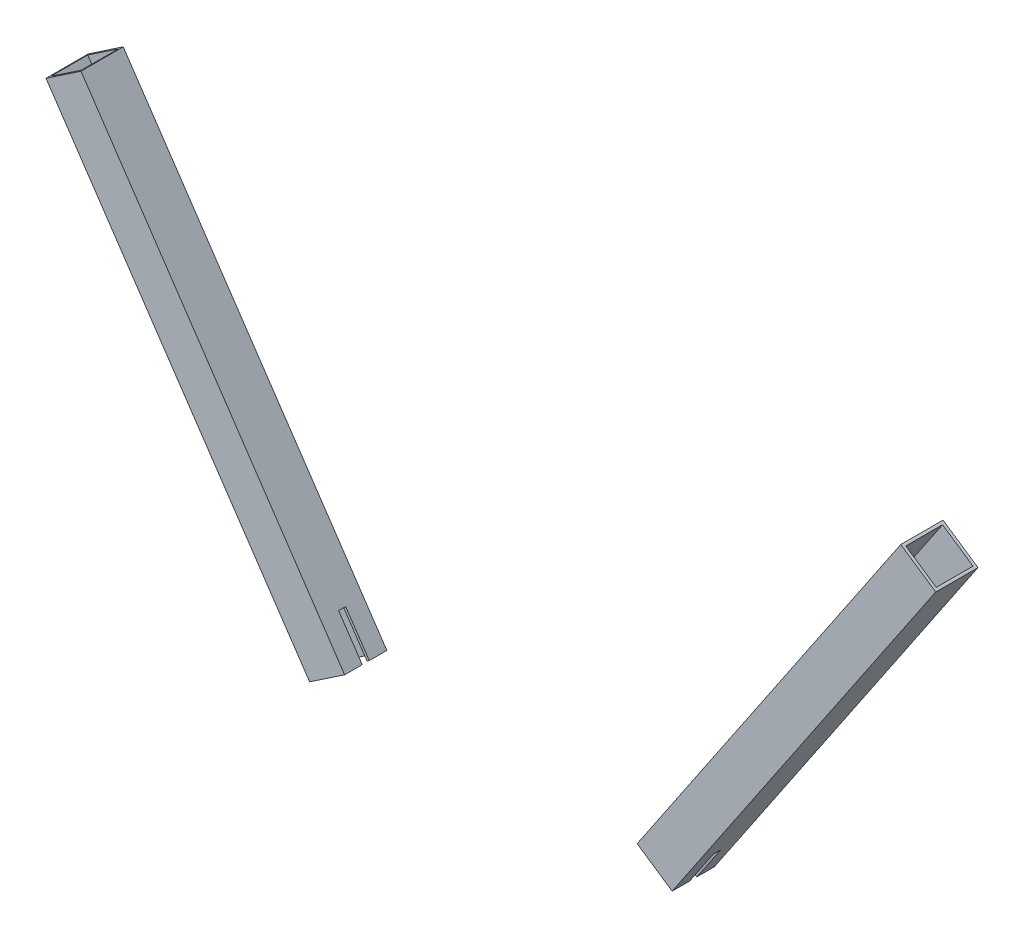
ISO-10303-21;
HEADER;
FILE_DESCRIPTION(('STEP AP214'),'2;1');
FILE_NAME('part.step','',(''),(''),'','','');
FILE_SCHEMA(('AUTOMOTIVE_DESIGN { 1 0 10303 214 1 1 1 1 }'));
ENDSEC;
DATA;
#1=APPLICATION_CONTEXT('core data for automotive mechanical design processes');
#2=APPLICATION_PROTOCOL_DEFINITION('international standard','automotive_design',2000,#1);
#3=PRODUCT_CONTEXT('',#1,'mechanical');
#4=PRODUCT('Part','Part','',(#3));
#5=PRODUCT_RELATED_PRODUCT_CATEGORY('part','',(#4));
#6=PRODUCT_DEFINITION_FORMATION('','',#4);
#7=PRODUCT_DEFINITION_CONTEXT('part definition',#1,'design');
#8=PRODUCT_DEFINITION('design','',#6,#7);
#9=PRODUCT_DEFINITION_SHAPE('','',#8);
#10=(LENGTH_UNIT() NAMED_UNIT(*) SI_UNIT(.MILLI.,.METRE.));
#11=(NAMED_UNIT(*) PLANE_ANGLE_UNIT() SI_UNIT($,.RADIAN.));
#12=(NAMED_UNIT(*) SI_UNIT($,.STERADIAN.) SOLID_ANGLE_UNIT());
#13=UNCERTAINTY_MEASURE_WITH_UNIT(LENGTH_MEASURE(1.E-05),#10,'distance_accuracy_value','');
#14=(GEOMETRIC_REPRESENTATION_CONTEXT(3) GLOBAL_UNCERTAINTY_ASSIGNED_CONTEXT((#13)) GLOBAL_UNIT_ASSIGNED_CONTEXT((#10,
#11,#12)) REPRESENTATION_CONTEXT('',''));
#15=CARTESIAN_POINT('',(0.,0.,0.));
#16=DIRECTION('',(0.,0.,1.));
#17=DIRECTION('',(1.,0.,0.));
#18=AXIS2_PLACEMENT_3D('',#15,#16,#17);
#19=CARTESIAN_POINT('',(-73.99949599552,101.56548835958,-1.5875));
#20=DIRECTION('',(0.559119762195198,-0.829086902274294,0.));
#21=DIRECTION('',(0.,0.,-1.));
#22=AXIS2_PLACEMENT_3D('',#19,#20,#21);
#23=PLANE('',#22);
#24=DIRECTION('',(-0.829086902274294,-0.559119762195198,0.));
#25=VECTOR('',#24,1.);
#26=CARTESIAN_POINT('',(-73.99949599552,101.56548835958,-1.5875));
#27=LINE('',#26,#25);
#28=CARTESIAN_POINT('',(-91.41512964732,89.820730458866,-1.5875));
#29=VERTEX_POINT('',#28);
#30=CARTESIAN_POINT('',(-92.42595239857,89.139051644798,-1.5875));
#31=VERTEX_POINT('',#30);
#32=EDGE_CURVE('P0_E307',#29,#31,#27,.T.);
#33=ORIENTED_EDGE('',*,*,#32,.F.);
#34=DIRECTION('',(0.,0.,1.));
#35=VECTOR('',#34,1.);
#36=CARTESIAN_POINT('',(-91.41512964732,89.820730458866,-4.94665));
#37=LINE('',#36,#35);
#38=CARTESIAN_POINT('',(-91.41512964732,89.820730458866,1.5875));
#39=VERTEX_POINT('',#38);
#40=EDGE_CURVE('P0_E298',#29,#39,#37,.T.);
#41=ORIENTED_EDGE('',*,*,#40,.T.);
#42=DIRECTION('',(-0.829086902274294,-0.559119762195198,0.));
#43=VECTOR('',#42,1.);
#44=CARTESIAN_POINT('',(-73.99949599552,101.56548835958,1.5875));
#45=LINE('',#44,#43);
#46=CARTESIAN_POINT('',(-92.42595239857,89.139051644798,1.5875));
#47=VERTEX_POINT('',#46);
#48=EDGE_CURVE('P0_E11',#39,#47,#45,.T.);
#49=ORIENTED_EDGE('',*,*,#48,.T.);
#50=DIRECTION('',(0.,0.,1.));
#51=VECTOR('',#50,1.);
#52=CARTESIAN_POINT('',(-92.42595239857,89.139051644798,-5.55625));
#53=LINE('',#52,#51);
#54=EDGE_CURVE('P0_E323',#31,#47,#53,.T.);
#55=ORIENTED_EDGE('',*,*,#54,.F.);
#56=EDGE_LOOP('',(#33,#41,#49,#55));
#57=FACE_BOUND('',#56,.T.);
#58=ADVANCED_FACE('P0_F17',(#57),#23,.T.);
#59=CARTESIAN_POINT('',(-63.20183329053,62.839973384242,1.5875));
#60=DIRECTION('',(0.,0.,1.));
#61=DIRECTION('',(1.,0.,0.));
#62=AXIS2_PLACEMENT_3D('',#59,#60,#61);
#63=PLANE('',#62);
#64=DIRECTION('',(-0.559119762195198,0.829086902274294,0.));
#65=VECTOR('',#64,1.);
#66=CARTESIAN_POINT('',(-68.32515975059,55.581927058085,1.5875));
#67=LINE('',#66,#65);
#68=CARTESIAN_POINT('',(-80.7638981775,74.026624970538,1.5875));
#69=VERTEX_POINT('',#68);
#70=EDGE_CURVE('P0_E294',#69,#39,#67,.T.);
#71=ORIENTED_EDGE('',*,*,#70,.F.);
#72=DIRECTION('',(0.829086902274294,0.559119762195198,0.));
#73=VECTOR('',#72,1.);
#74=CARTESIAN_POINT('',(-69.92914181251,81.333369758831,1.5875));
#75=LINE('',#74,#73);
#76=CARTESIAN_POINT('',(-81.77472092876,73.34494615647,1.5875));
#77=VERTEX_POINT('',#76);
#78=EDGE_CURVE('P0_E50',#77,#69,#75,.T.);
#79=ORIENTED_EDGE('',*,*,#78,.F.);
#80=DIRECTION('',(-0.559119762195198,0.829086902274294,0.));
#81=VECTOR('',#80,1.);
#82=CARTESIAN_POINT('',(-76.43680348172,65.429651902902,1.5875));
#83=LINE('',#82,#81);
#84=EDGE_CURVE('P0_E330',#77,#47,#83,.T.);
#85=ORIENTED_EDGE('',*,*,#84,.T.);
#86=ORIENTED_EDGE('',*,*,#48,.F.);
#87=EDGE_LOOP('',(#71,#79,#85,#86));
#88=FACE_BOUND('',#87,.T.);
#89=ADVANCED_FACE('P0_F394',(#88),#63,.F.);
#90=CARTESIAN_POINT('',(-52.78979623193,62.255691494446,8.3058));
#91=DIRECTION('',(0.,0.,1.));
#92=DIRECTION('',(1.,0.,0.));
#93=AXIS2_PLACEMENT_3D('',#90,#91,#92);
#94=PLANE('',#93);
#95=DIRECTION('',(0.829086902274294,0.559119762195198,0.));
#96=VECTOR('',#95,1.);
#97=CARTESIAN_POINT('',(-185.4247782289,260.02284950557,8.3058));
#98=LINE('',#97,#96);
#99=CARTESIAN_POINT('',(-199.7026495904,250.39413625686,8.3058));
#100=VERTEX_POINT('',#99);
#101=CARTESIAN_POINT('',(-185.9301896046,259.68201009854,8.3058));
#102=VERTEX_POINT('',#101);
#103=EDGE_CURVE('P0_E339',#100,#102,#98,.T.);
#104=ORIENTED_EDGE('',*,*,#103,.T.);
#105=DIRECTION('',(-0.559119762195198,0.829086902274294,0.));
#106=VECTOR('',#105,1.);
#107=CARTESIAN_POINT('',(-52.78979623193,62.255691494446,8.3058));
#108=LINE('',#107,#106);
#109=CARTESIAN_POINT('',(-66.99143819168,83.314498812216,8.3058));
#110=VERTEX_POINT('',#109);
#111=EDGE_CURVE('P0_E268',#110,#102,#108,.T.);
#112=ORIENTED_EDGE('',*,*,#111,.F.);
#113=DIRECTION('',(0.829086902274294,0.559119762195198,0.));
#114=VECTOR('',#113,1.);
#115=CARTESIAN_POINT('',(-66.48602681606,83.65533821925,8.3058));
#116=LINE('',#115,#114);
#117=CARTESIAN_POINT('',(-80.7638981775,74.026624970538,8.3058));
#118=VERTEX_POINT('',#117);
#119=EDGE_CURVE('P0_E338',#118,#110,#116,.T.);
#120=ORIENTED_EDGE('',*,*,#119,.F.);
#121=DIRECTION('',(-0.559119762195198,0.829086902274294,0.));
#122=VECTOR('',#121,1.);
#123=CARTESIAN_POINT('',(-66.56225621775,52.967817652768,8.3058));
#124=LINE('',#123,#122);
#125=EDGE_CURVE('P0_E290',#118,#100,#124,.T.);
#126=ORIENTED_EDGE('',*,*,#125,.T.);
#127=EDGE_LOOP('',(#104,#112,#120,#126));
#128=FACE_BOUND('',#127,.T.);
#129=ADVANCED_FACE('P0_F364',(#128),#94,.F.);
#130=CARTESIAN_POINT('',(-73.99949599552,101.56548835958,-1.5875));
#131=DIRECTION('',(0.559119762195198,-0.829086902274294,0.));
#132=DIRECTION('',(0.,0.,-1.));
#133=AXIS2_PLACEMENT_3D('',#130,#131,#132);
#134=PLANE('',#133);
#135=DIRECTION('',(-0.829086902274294,-0.559119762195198,0.));
#136=VECTOR('',#135,1.);
#137=CARTESIAN_POINT('',(-73.99949599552,101.56548835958,-1.5875));
#138=LINE('',#137,#136);
#139=CARTESIAN_POINT('',(-76.63184691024,99.790283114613,-1.5875));
#140=VERTEX_POINT('',#139);
#141=CARTESIAN_POINT('',(-77.6426696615,99.108604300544,-1.5875));
#142=VERTEX_POINT('',#141);
#143=EDGE_CURVE('P0_E175',#140,#142,#138,.T.);
#144=ORIENTED_EDGE('',*,*,#143,.F.);
#145=DIRECTION('',(0.,0.,1.));
#146=VECTOR('',#145,1.);
#147=CARTESIAN_POINT('',(-76.63184691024,99.790283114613,-5.55625));
#148=LINE('',#147,#146);
#149=CARTESIAN_POINT('',(-76.63184691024,99.790283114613,1.5875));
#150=VERTEX_POINT('',#149);
#151=EDGE_CURVE('P0_E219',#140,#150,#148,.T.);
#152=ORIENTED_EDGE('',*,*,#151,.T.);
#153=DIRECTION('',(-0.829086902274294,-0.559119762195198,0.));
#154=VECTOR('',#153,1.);
#155=CARTESIAN_POINT('',(-73.99949599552,101.56548835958,1.5875));
#156=LINE('',#155,#154);
#157=CARTESIAN_POINT('',(-77.6426696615,99.108604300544,1.5875));
#158=VERTEX_POINT('',#157);
#159=EDGE_CURVE('P0_E25',#150,#158,#156,.T.);
#160=ORIENTED_EDGE('',*,*,#159,.T.);
#161=DIRECTION('',(0.,0.,1.));
#162=VECTOR('',#161,1.);
#163=CARTESIAN_POINT('',(-77.6426696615,99.108604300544,-4.94665));
#164=LINE('',#163,#162);
#165=EDGE_CURVE('P0_E260',#142,#158,#164,.T.);
#166=ORIENTED_EDGE('',*,*,#165,.F.);
#167=EDGE_LOOP('',(#144,#152,#160,#166));
#168=FACE_BOUND('',#167,.T.);
#169=ADVANCED_FACE('P0_F352',(#168),#134,.T.);
#170=CARTESIAN_POINT('',(-63.20183329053,62.839973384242,1.5875));
#171=DIRECTION('',(0.,0.,1.));
#172=DIRECTION('',(1.,0.,0.));
#173=AXIS2_PLACEMENT_3D('',#170,#171,#172);
#174=PLANE('',#173);
#175=DIRECTION('',(0.829086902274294,0.559119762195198,0.));
#176=VECTOR('',#175,1.);
#177=CARTESIAN_POINT('',(-69.92914181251,81.333369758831,1.5875));
#178=LINE('',#177,#176);
#179=CARTESIAN_POINT('',(-66.99143819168,83.314498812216,1.5875));
#180=VERTEX_POINT('',#179);
#181=CARTESIAN_POINT('',(-65.98061544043,83.996177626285,1.5875));
#182=VERTEX_POINT('',#181);
#183=EDGE_CURVE('P0_E345',#180,#182,#178,.T.);
#184=ORIENTED_EDGE('',*,*,#183,.F.);
#185=DIRECTION('',(-0.559119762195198,0.829086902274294,0.));
#186=VECTOR('',#185,1.);
#187=CARTESIAN_POINT('',(-54.55269976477,64.869800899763,1.5875));
#188=LINE('',#187,#186);
#189=EDGE_CURVE('P0_E257',#180,#158,#188,.T.);
#190=ORIENTED_EDGE('',*,*,#189,.T.);
#191=ORIENTED_EDGE('',*,*,#159,.F.);
#192=DIRECTION('',(-0.559119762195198,0.829086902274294,0.));
#193=VECTOR('',#192,1.);
#194=CARTESIAN_POINT('',(-60.6426979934,76.080883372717,1.5875));
#195=LINE('',#194,#193);
#196=EDGE_CURVE('P0_E223',#182,#150,#195,.T.);
#197=ORIENTED_EDGE('',*,*,#196,.F.);
#198=EDGE_LOOP('',(#184,#190,#191,#197));
#199=FACE_BOUND('',#198,.T.);
#200=ADVANCED_FACE('P0_F358',(#199),#174,.F.);
#201=CARTESIAN_POINT('',(-65.98061544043,83.996177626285,-9.525));
#202=DIRECTION('',(-0.559119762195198,0.829086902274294,0.));
#203=DIRECTION('',(0.,0.,1.));
#204=AXIS2_PLACEMENT_3D('',#201,#202,#203);
#205=PLANE('',#204);
#206=DIRECTION('',(-0.829086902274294,-0.559119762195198,0.));
#207=VECTOR('',#206,1.);
#208=CARTESIAN_POINT('',(-65.98061544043,83.996177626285,9.525));
#209=LINE('',#208,#207);
#210=CARTESIAN_POINT('',(-65.98061544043,83.996177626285,9.525));
#211=VERTEX_POINT('',#210);
#212=CARTESIAN_POINT('',(-81.77472092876,73.34494615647,9.525));
#213=VERTEX_POINT('',#212);
#214=EDGE_CURVE('P0_E40',#211,#213,#209,.T.);
#215=ORIENTED_EDGE('',*,*,#214,.T.);
#216=DIRECTION('',(0.,0.,1.));
#217=VECTOR('',#216,1.);
#218=CARTESIAN_POINT('',(-81.77472092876,73.34494615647,-9.525));
#219=LINE('',#218,#217);
#220=EDGE_CURVE('P0_E238',#77,#213,#219,.T.);
#221=ORIENTED_EDGE('',*,*,#220,.F.);
#222=ORIENTED_EDGE('',*,*,#78,.T.);
#223=DIRECTION('',(0.,0.,1.));
#224=VECTOR('',#223,1.);
#225=CARTESIAN_POINT('',(-80.7638981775,74.026624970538,-8.9154));
#226=LINE('',#225,#224);
#227=EDGE_CURVE('P0_E295',#69,#118,#226,.T.);
#228=ORIENTED_EDGE('',*,*,#227,.T.);
#229=ORIENTED_EDGE('',*,*,#119,.T.);
#230=DIRECTION('',(0.,0.,1.));
#231=VECTOR('',#230,1.);
#232=CARTESIAN_POINT('',(-66.99143819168,83.314498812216,-8.9154));
#233=LINE('',#232,#231);
#234=EDGE_CURVE('P0_E262',#180,#110,#233,.T.);
#235=ORIENTED_EDGE('',*,*,#234,.F.);
#236=ORIENTED_EDGE('',*,*,#183,.T.);
#237=DIRECTION('',(0.,0.,1.));
#238=VECTOR('',#237,1.);
#239=CARTESIAN_POINT('',(-65.98061544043,83.996177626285,-9.525));
#240=LINE('',#239,#238);
#241=EDGE_CURVE('P0_E214',#182,#211,#240,.T.);
#242=ORIENTED_EDGE('',*,*,#241,.T.);
#243=EDGE_LOOP('',(#215,#221,#222,#228,#229,#235,#236,#242));
#244=FACE_BOUND('',#243,.T.);
#245=ADVANCED_FACE('P0_F363',(#244),#205,.F.);
#246=CARTESIAN_POINT('',(-65.98061544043,83.996177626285,9.525));
#247=DIRECTION('',(0.,0.,1.));
#248=DIRECTION('',(1.,0.,0.));
#249=AXIS2_PLACEMENT_3D('',#246,#247,#248);
#250=PLANE('',#249);
#251=ORIENTED_EDGE('',*,*,#214,.F.);
#252=DIRECTION('',(-0.559119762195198,0.829086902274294,0.));
#253=VECTOR('',#252,1.);
#254=CARTESIAN_POINT('',(-65.98061544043,83.996177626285,9.525));
#255=LINE('',#254,#253);
#256=CARTESIAN_POINT('',(-184.9193668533,260.36368891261,9.525));
#257=VERTEX_POINT('',#256);
#258=EDGE_CURVE('P0_E211',#211,#257,#255,.T.);
#259=ORIENTED_EDGE('',*,*,#258,.T.);
#260=DIRECTION('',(-0.829086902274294,-0.559119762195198,0.));
#261=VECTOR('',#260,1.);
#262=CARTESIAN_POINT('',(-184.9193668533,260.36368891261,9.525));
#263=LINE('',#262,#261);
#264=CARTESIAN_POINT('',(-200.7134723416,249.71245744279,9.525));
#265=VERTEX_POINT('',#264);
#266=EDGE_CURVE('P0_E333',#257,#265,#263,.T.);
#267=ORIENTED_EDGE('',*,*,#266,.T.);
#268=DIRECTION('',(-0.559119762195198,0.829086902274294,0.));
#269=VECTOR('',#268,1.);
#270=CARTESIAN_POINT('',(-81.77472092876,73.34494615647,9.525));
#271=LINE('',#270,#269);
#272=EDGE_CURVE('P0_E233',#213,#265,#271,.T.);
#273=ORIENTED_EDGE('',*,*,#272,.F.);
#274=EDGE_LOOP('',(#251,#259,#267,#273));
#275=FACE_BOUND('',#274,.T.);
#276=ADVANCED_FACE('P0_F391',(#275),#250,.T.);
#277=CARTESIAN_POINT('',(-184.9193668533,260.36368891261,-9.525));
#278=DIRECTION('',(-0.559119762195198,0.829086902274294,0.));
#279=DIRECTION('',(0.,0.,1.));
#280=AXIS2_PLACEMENT_3D('',#277,#278,#279);
#281=PLANE('',#280);
#282=DIRECTION('',(0.829086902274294,0.559119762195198,0.));
#283=VECTOR('',#282,1.);
#284=CARTESIAN_POINT('',(-185.4247782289,260.02284950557,-8.3058));
#285=LINE('',#284,#283);
#286=CARTESIAN_POINT('',(-199.7026495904,250.39413625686,-8.3058));
#287=VERTEX_POINT('',#286);
#288=CARTESIAN_POINT('',(-185.9301896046,259.68201009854,-8.3058));
#289=VERTEX_POINT('',#288);
#290=EDGE_CURVE('P0_E278',#287,#289,#285,.T.);
#291=ORIENTED_EDGE('',*,*,#290,.T.);
#292=DIRECTION('',(0.,0.,1.));
#293=VECTOR('',#292,1.);
#294=CARTESIAN_POINT('',(-185.9301896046,259.68201009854,-8.9154));
#295=LINE('',#294,#293);
#296=EDGE_CURVE('P0_E275',#289,#102,#295,.T.);
#297=ORIENTED_EDGE('',*,*,#296,.T.);
#298=ORIENTED_EDGE('',*,*,#103,.F.);
#299=DIRECTION('',(0.,0.,1.));
#300=VECTOR('',#299,1.);
#301=CARTESIAN_POINT('',(-199.7026495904,250.39413625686,-8.9154));
#302=LINE('',#301,#300);
#303=EDGE_CURVE('P0_E284',#287,#100,#302,.T.);
#304=ORIENTED_EDGE('',*,*,#303,.F.);
#305=EDGE_LOOP('',(#291,#297,#298,#304));
#306=FACE_BOUND('',#305,.T.);
#307=DIRECTION('',(0.,0.,1.));
#308=VECTOR('',#307,1.);
#309=CARTESIAN_POINT('',(-184.9193668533,260.36368891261,-9.525));
#310=LINE('',#309,#308);
#311=CARTESIAN_POINT('',(-184.9193668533,260.36368891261,-9.525));
#312=VERTEX_POINT('',#311);
#313=EDGE_CURVE('P0_E206',#312,#257,#310,.T.);
#314=ORIENTED_EDGE('',*,*,#313,.F.);
#315=DIRECTION('',(-0.829086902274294,-0.559119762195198,0.));
#316=VECTOR('',#315,1.);
#317=CARTESIAN_POINT('',(-184.9193668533,260.36368891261,-9.525));
#318=LINE('',#317,#316);
#319=CARTESIAN_POINT('',(-200.7134723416,249.71245744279,-9.525));
#320=VERTEX_POINT('',#319);
#321=EDGE_CURVE('P0_E236',#312,#320,#318,.T.);
#322=ORIENTED_EDGE('',*,*,#321,.T.);
#323=DIRECTION('',(0.,0.,1.));
#324=VECTOR('',#323,1.);
#325=CARTESIAN_POINT('',(-200.7134723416,249.71245744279,-9.525));
#326=LINE('',#325,#324);
#327=EDGE_CURVE('P0_E312',#320,#265,#326,.T.);
#328=ORIENTED_EDGE('',*,*,#327,.T.);
#329=ORIENTED_EDGE('',*,*,#266,.F.);
#330=EDGE_LOOP('',(#314,#322,#328,#329));
#331=FACE_BOUND('',#330,.T.);
#332=ADVANCED_FACE('P0_F370',(#306,#331),#281,.T.);
#333=CARTESIAN_POINT('',(-65.98061544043,83.996177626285,-9.525));
#334=DIRECTION('',(0.,0.,1.));
#335=DIRECTION('',(1.,0.,0.));
#336=AXIS2_PLACEMENT_3D('',#333,#334,#335);
#337=PLANE('',#336);
#338=DIRECTION('',(-0.559119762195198,0.829086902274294,0.));
#339=VECTOR('',#338,1.);
#340=CARTESIAN_POINT('',(-81.77472092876,73.34494615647,-9.525));
#341=LINE('',#340,#339);
#342=CARTESIAN_POINT('',(-81.77472092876,73.34494615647,-9.525));
#343=VERTEX_POINT('',#342);
#344=EDGE_CURVE('P0_E317',#343,#320,#341,.T.);
#345=ORIENTED_EDGE('',*,*,#344,.T.);
#346=ORIENTED_EDGE('',*,*,#321,.F.);
#347=DIRECTION('',(-0.559119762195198,0.829086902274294,0.));
#348=VECTOR('',#347,1.);
#349=CARTESIAN_POINT('',(-65.98061544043,83.996177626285,-9.525));
#350=LINE('',#349,#348);
#351=CARTESIAN_POINT('',(-65.98061544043,83.996177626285,-9.525));
#352=VERTEX_POINT('',#351);
#353=EDGE_CURVE('P0_E244',#352,#312,#350,.T.);
#354=ORIENTED_EDGE('',*,*,#353,.F.);
#355=DIRECTION('',(-0.829086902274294,-0.559119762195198,0.));
#356=VECTOR('',#355,1.);
#357=CARTESIAN_POINT('',(-65.98061544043,83.996177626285,-9.525));
#358=LINE('',#357,#356);
#359=EDGE_CURVE('P0_E228',#352,#343,#358,.T.);
#360=ORIENTED_EDGE('',*,*,#359,.T.);
#361=EDGE_LOOP('',(#345,#346,#354,#360));
#362=FACE_BOUND('',#361,.T.);
#363=ADVANCED_FACE('P0_F383',(#362),#337,.F.);
#364=CARTESIAN_POINT('',(-81.77472092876,73.34494615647,-9.525));
#365=DIRECTION('',(-0.829086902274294,-0.559119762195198,0.));
#366=DIRECTION('',(-0.559119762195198,0.829086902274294,0.));
#367=AXIS2_PLACEMENT_3D('',#364,#365,#366);
#368=PLANE('',#367);
#369=ORIENTED_EDGE('',*,*,#327,.F.);
#370=ORIENTED_EDGE('',*,*,#344,.F.);
#371=DIRECTION('',(0.,0.,1.));
#372=VECTOR('',#371,1.);
#373=CARTESIAN_POINT('',(-81.77472092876,73.34494615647,-9.525));
#374=LINE('',#373,#372);
#375=CARTESIAN_POINT('',(-81.77472092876,73.34494615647,-1.5875));
#376=VERTEX_POINT('',#375);
#377=EDGE_CURVE('P0_E218',#343,#376,#374,.T.);
#378=ORIENTED_EDGE('',*,*,#377,.T.);
#379=DIRECTION('',(-0.559119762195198,0.829086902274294,0.));
#380=VECTOR('',#379,1.);
#381=CARTESIAN_POINT('',(-76.43680348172,65.429651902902,-1.5875));
#382=LINE('',#381,#380);
#383=EDGE_CURVE('P0_E313',#376,#31,#382,.T.);
#384=ORIENTED_EDGE('',*,*,#383,.T.);
#385=ORIENTED_EDGE('',*,*,#54,.T.);
#386=ORIENTED_EDGE('',*,*,#84,.F.);
#387=ORIENTED_EDGE('',*,*,#220,.T.);
#388=ORIENTED_EDGE('',*,*,#272,.T.);
#389=EDGE_LOOP('',(#369,#370,#378,#384,#385,#386,#387,#388));
#390=FACE_BOUND('',#389,.T.);
#391=ADVANCED_FACE('P0_F385',(#390),#368,.T.);
#392=CARTESIAN_POINT('',(-63.20183329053,62.839973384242,-1.5875));
#393=DIRECTION('',(0.,0.,1.));
#394=DIRECTION('',(1.,0.,0.));
#395=AXIS2_PLACEMENT_3D('',#392,#393,#394);
#396=PLANE('',#395);
#397=ORIENTED_EDGE('',*,*,#32,.T.);
#398=ORIENTED_EDGE('',*,*,#383,.F.);
#399=DIRECTION('',(0.829086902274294,0.559119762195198,0.));
#400=VECTOR('',#399,1.);
#401=CARTESIAN_POINT('',(-69.92914181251,81.333369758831,-1.5875));
#402=LINE('',#401,#400);
#403=CARTESIAN_POINT('',(-80.7638981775,74.026624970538,-1.5875));
#404=VERTEX_POINT('',#403);
#405=EDGE_CURVE('P0_E209',#376,#404,#402,.T.);
#406=ORIENTED_EDGE('',*,*,#405,.T.);
#407=DIRECTION('',(-0.559119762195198,0.829086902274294,0.));
#408=VECTOR('',#407,1.);
#409=CARTESIAN_POINT('',(-68.32515975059,55.581927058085,-1.5875));
#410=LINE('',#409,#408);
#411=EDGE_CURVE('P0_E303',#404,#29,#410,.T.);
#412=ORIENTED_EDGE('',*,*,#411,.T.);
#413=EDGE_LOOP('',(#397,#398,#406,#412));
#414=FACE_BOUND('',#413,.T.);
#415=ADVANCED_FACE('P0_F377',(#414),#396,.T.);
#416=CARTESIAN_POINT('',(-66.56225621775,52.967817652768,-8.3058));
#417=DIRECTION('',(-0.829086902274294,-0.559119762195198,0.));
#418=DIRECTION('',(-0.559119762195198,0.829086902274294,0.));
#419=AXIS2_PLACEMENT_3D('',#416,#417,#418);
#420=PLANE('',#419);
#421=ORIENTED_EDGE('',*,*,#303,.T.);
#422=ORIENTED_EDGE('',*,*,#125,.F.);
#423=ORIENTED_EDGE('',*,*,#227,.F.);
#424=ORIENTED_EDGE('',*,*,#70,.T.);
#425=ORIENTED_EDGE('',*,*,#40,.F.);
#426=ORIENTED_EDGE('',*,*,#411,.F.);
#427=DIRECTION('',(0.,0.,1.));
#428=VECTOR('',#427,1.);
#429=CARTESIAN_POINT('',(-80.7638981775,74.026624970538,-8.9154));
#430=LINE('',#429,#428);
#431=CARTESIAN_POINT('',(-80.7638981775,74.026624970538,-8.3058));
#432=VERTEX_POINT('',#431);
#433=EDGE_CURVE('P0_E201',#432,#404,#430,.T.);
#434=ORIENTED_EDGE('',*,*,#433,.F.);
#435=DIRECTION('',(-0.559119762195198,0.829086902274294,0.));
#436=VECTOR('',#435,1.);
#437=CARTESIAN_POINT('',(-66.56225621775,52.967817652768,-8.3058));
#438=LINE('',#437,#436);
#439=EDGE_CURVE('P0_E277',#432,#287,#438,.T.);
#440=ORIENTED_EDGE('',*,*,#439,.T.);
#441=EDGE_LOOP('',(#421,#422,#423,#424,#425,#426,#434,#440));
#442=FACE_BOUND('',#441,.T.);
#443=ADVANCED_FACE('P0_F376',(#442),#420,.F.);
#444=CARTESIAN_POINT('',(-52.78979623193,62.255691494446,-8.3058));
#445=DIRECTION('',(0.,0.,1.));
#446=DIRECTION('',(1.,0.,0.));
#447=AXIS2_PLACEMENT_3D('',#444,#445,#446);
#448=PLANE('',#447);
#449=ORIENTED_EDGE('',*,*,#439,.F.);
#450=DIRECTION('',(0.829086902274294,0.559119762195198,0.));
#451=VECTOR('',#450,1.);
#452=CARTESIAN_POINT('',(-66.48602681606,83.65533821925,-8.3058));
#453=LINE('',#452,#451);
#454=CARTESIAN_POINT('',(-66.99143819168,83.314498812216,-8.3058));
#455=VERTEX_POINT('',#454);
#456=EDGE_CURVE('P0_E189',#432,#455,#453,.T.);
#457=ORIENTED_EDGE('',*,*,#456,.T.);
#458=DIRECTION('',(-0.559119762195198,0.829086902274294,0.));
#459=VECTOR('',#458,1.);
#460=CARTESIAN_POINT('',(-52.78979623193,62.255691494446,-8.3058));
#461=LINE('',#460,#459);
#462=EDGE_CURVE('P0_E177',#455,#289,#461,.T.);
#463=ORIENTED_EDGE('',*,*,#462,.T.);
#464=ORIENTED_EDGE('',*,*,#290,.F.);
#465=EDGE_LOOP('',(#449,#457,#463,#464));
#466=FACE_BOUND('',#465,.T.);
#467=ADVANCED_FACE('P0_F371',(#466),#448,.T.);
#468=CARTESIAN_POINT('',(-52.78979623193,62.255691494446,-8.3058));
#469=DIRECTION('',(-0.829086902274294,-0.559119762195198,0.));
#470=DIRECTION('',(-0.559119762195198,0.829086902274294,0.));
#471=AXIS2_PLACEMENT_3D('',#468,#469,#470);
#472=PLANE('',#471);
#473=ORIENTED_EDGE('',*,*,#462,.F.);
#474=DIRECTION('',(0.,0.,1.));
#475=VECTOR('',#474,1.);
#476=CARTESIAN_POINT('',(-66.99143819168,83.314498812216,-8.9154));
#477=LINE('',#476,#475);
#478=CARTESIAN_POINT('',(-66.99143819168,83.314498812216,-1.5875));
#479=VERTEX_POINT('',#478);
#480=EDGE_CURVE('P0_E181',#455,#479,#477,.T.);
#481=ORIENTED_EDGE('',*,*,#480,.T.);
#482=DIRECTION('',(-0.559119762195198,0.829086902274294,0.));
#483=VECTOR('',#482,1.);
#484=CARTESIAN_POINT('',(-54.55269976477,64.869800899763,-1.5875));
#485=LINE('',#484,#483);
#486=EDGE_CURVE('P0_E166',#479,#142,#485,.T.);
#487=ORIENTED_EDGE('',*,*,#486,.T.);
#488=ORIENTED_EDGE('',*,*,#165,.T.);
#489=ORIENTED_EDGE('',*,*,#189,.F.);
#490=ORIENTED_EDGE('',*,*,#234,.T.);
#491=ORIENTED_EDGE('',*,*,#111,.T.);
#492=ORIENTED_EDGE('',*,*,#296,.F.);
#493=EDGE_LOOP('',(#473,#481,#487,#488,#489,#490,#491,#492));
#494=FACE_BOUND('',#493,.T.);
#495=ADVANCED_FACE('P0_F183',(#494),#472,.T.);
#496=CARTESIAN_POINT('',(-63.20183329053,62.839973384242,-1.5875));
#497=DIRECTION('',(0.,0.,1.));
#498=DIRECTION('',(1.,0.,0.));
#499=AXIS2_PLACEMENT_3D('',#496,#497,#498);
#500=PLANE('',#499);
#501=DIRECTION('',(-0.559119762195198,0.829086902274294,0.));
#502=VECTOR('',#501,1.);
#503=CARTESIAN_POINT('',(-60.6426979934,76.080883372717,-1.5875));
#504=LINE('',#503,#502);
#505=CARTESIAN_POINT('',(-65.98061544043,83.996177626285,-1.5875));
#506=VERTEX_POINT('',#505);
#507=EDGE_CURVE('P0_E221',#506,#140,#504,.T.);
#508=ORIENTED_EDGE('',*,*,#507,.T.);
#509=ORIENTED_EDGE('',*,*,#143,.T.);
#510=ORIENTED_EDGE('',*,*,#486,.F.);
#511=DIRECTION('',(0.829086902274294,0.559119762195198,0.));
#512=VECTOR('',#511,1.);
#513=CARTESIAN_POINT('',(-69.92914181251,81.333369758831,-1.5875));
#514=LINE('',#513,#512);
#515=EDGE_CURVE('P0_E173',#479,#506,#514,.T.);
#516=ORIENTED_EDGE('',*,*,#515,.T.);
#517=EDGE_LOOP('',(#508,#509,#510,#516));
#518=FACE_BOUND('',#517,.T.);
#519=ADVANCED_FACE('P0_F172',(#518),#500,.T.);
#520=CARTESIAN_POINT('',(-65.98061544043,83.996177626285,-9.525));
#521=DIRECTION('',(-0.829086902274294,-0.559119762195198,0.));
#522=DIRECTION('',(-0.559119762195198,0.829086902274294,0.));
#523=AXIS2_PLACEMENT_3D('',#520,#521,#522);
#524=PLANE('',#523);
#525=ORIENTED_EDGE('',*,*,#258,.F.);
#526=ORIENTED_EDGE('',*,*,#241,.F.);
#527=ORIENTED_EDGE('',*,*,#196,.T.);
#528=ORIENTED_EDGE('',*,*,#151,.F.);
#529=ORIENTED_EDGE('',*,*,#507,.F.);
#530=DIRECTION('',(0.,0.,1.));
#531=VECTOR('',#530,1.);
#532=CARTESIAN_POINT('',(-65.98061544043,83.996177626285,-9.525));
#533=LINE('',#532,#531);
#534=EDGE_CURVE('P0_E198',#352,#506,#533,.T.);
#535=ORIENTED_EDGE('',*,*,#534,.F.);
#536=ORIENTED_EDGE('',*,*,#353,.T.);
#537=ORIENTED_EDGE('',*,*,#313,.T.);
#538=EDGE_LOOP('',(#525,#526,#527,#528,#529,#535,#536,#537));
#539=FACE_BOUND('',#538,.T.);
#540=ADVANCED_FACE('P0_F389',(#539),#524,.F.);
#541=CARTESIAN_POINT('',(-65.98061544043,83.996177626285,-9.525));
#542=DIRECTION('',(-0.559119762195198,0.829086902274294,0.));
#543=DIRECTION('',(0.,0.,1.));
#544=AXIS2_PLACEMENT_3D('',#541,#542,#543);
#545=PLANE('',#544);
#546=ORIENTED_EDGE('',*,*,#515,.F.);
#547=ORIENTED_EDGE('',*,*,#480,.F.);
#548=ORIENTED_EDGE('',*,*,#456,.F.);
#549=ORIENTED_EDGE('',*,*,#433,.T.);
#550=ORIENTED_EDGE('',*,*,#405,.F.);
#551=ORIENTED_EDGE('',*,*,#377,.F.);
#552=ORIENTED_EDGE('',*,*,#359,.F.);
#553=ORIENTED_EDGE('',*,*,#534,.T.);
#554=EDGE_LOOP('',(#546,#547,#548,#549,#550,#551,#552,#553));
#555=FACE_BOUND('',#554,.T.);
#556=ADVANCED_FACE('P0_F193',(#555),#545,.F.);
#557=CLOSED_SHELL('',(#58,#89,#129,#169,#200,#245,#276,#332,#363,#391,#415,#443,#467,#495,#519,
#540,#556));
#558=MANIFOLD_SOLID_BREP('P0_B1',#557);
#559=CARTESIAN_POINT('',(95.058303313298,87.363846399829,-1.5875));
#560=DIRECTION('',(-0.559119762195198,-0.829086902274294,0.));
#561=DIRECTION('',(-0.829086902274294,0.559119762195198,0.));
#562=AXIS2_PLACEMENT_3D('',#559,#560,#561);
#563=PLANE('',#562);
#564=DIRECTION('',(-0.829086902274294,0.559119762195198,0.));
#565=VECTOR('',#564,1.);
#566=CARTESIAN_POINT('',(95.058303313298,87.363846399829,-1.5875));
#567=LINE('',#566,#565);
#568=CARTESIAN_POINT('',(77.642669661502,99.108604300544,-1.5875));
#569=VERTEX_POINT('',#568);
#570=CARTESIAN_POINT('',(76.631846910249,99.790283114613,-1.5875));
#571=VERTEX_POINT('',#570);
#572=EDGE_CURVE('P1_E208',#569,#571,#567,.T.);
#573=ORIENTED_EDGE('',*,*,#572,.F.);
#574=DIRECTION('',(0.,0.,1.));
#575=VECTOR('',#574,1.);
#576=CARTESIAN_POINT('',(77.642669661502,99.108604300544,-4.94665));
#577=LINE('',#576,#575);
#578=CARTESIAN_POINT('',(77.642669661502,99.108604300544,1.5875));
#579=VERTEX_POINT('',#578);
#580=EDGE_CURVE('P1_E187',#569,#579,#577,.T.);
#581=ORIENTED_EDGE('',*,*,#580,.T.);
#582=DIRECTION('',(-0.829086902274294,0.559119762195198,0.));
#583=VECTOR('',#582,1.);
#584=CARTESIAN_POINT('',(95.058303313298,87.363846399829,1.5875));
#585=LINE('',#584,#583);
#586=CARTESIAN_POINT('',(76.631846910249,99.790283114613,1.5875));
#587=VERTEX_POINT('',#586);
#588=EDGE_CURVE('P1_E10',#579,#587,#585,.T.);
#589=ORIENTED_EDGE('',*,*,#588,.T.);
#590=DIRECTION('',(0.,0.,1.));
#591=VECTOR('',#590,1.);
#592=CARTESIAN_POINT('',(76.631846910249,99.790283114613,-5.55625));
#593=LINE('',#592,#591);
#594=EDGE_CURVE('P1_E221',#571,#587,#593,.T.);
#595=ORIENTED_EDGE('',*,*,#594,.F.);
#596=EDGE_LOOP('',(#573,#581,#589,#595));
#597=FACE_BOUND('',#596,.T.);
#598=ADVANCED_FACE('P1_F16',(#597),#563,.T.);
#599=CARTESIAN_POINT('',(63.20183329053,62.839973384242,1.5875));
#600=DIRECTION('',(0.,0.,1.));
#601=DIRECTION('',(1.,0.,0.));
#602=AXIS2_PLACEMENT_3D('',#599,#600,#601);
#603=PLANE('',#602);
#604=DIRECTION('',(0.559119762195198,0.829086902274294,0.));
#605=VECTOR('',#604,1.);
#606=CARTESIAN_POINT('',(54.552699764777,64.869800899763,1.5875));
#607=LINE('',#606,#605);
#608=CARTESIAN_POINT('',(66.991438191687,83.314498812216,1.5875));
#609=VERTEX_POINT('',#608);
#610=EDGE_CURVE('P1_E183',#609,#579,#607,.T.);
#611=ORIENTED_EDGE('',*,*,#610,.F.);
#612=DIRECTION('',(0.829086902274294,-0.559119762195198,0.));
#613=VECTOR('',#612,1.);
#614=CARTESIAN_POINT('',(77.82619455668,76.007754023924,1.5875));
#615=LINE('',#614,#613);
#616=CARTESIAN_POINT('',(65.980615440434,83.996177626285,1.5875));
#617=VERTEX_POINT('',#616);
#618=EDGE_CURVE('P1_E171',#617,#609,#615,.T.);
#619=ORIENTED_EDGE('',*,*,#618,.F.);
#620=DIRECTION('',(0.559119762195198,0.829086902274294,0.));
#621=VECTOR('',#620,1.);
#622=CARTESIAN_POINT('',(60.6426979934,76.080883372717,1.5875));
#623=LINE('',#622,#621);
#624=EDGE_CURVE('P1_E229',#617,#587,#623,.T.);
#625=ORIENTED_EDGE('',*,*,#624,.T.);
#626=ORIENTED_EDGE('',*,*,#588,.F.);
#627=EDGE_LOOP('',(#611,#619,#625,#626));
#628=FACE_BOUND('',#627,.T.);
#629=ADVANCED_FACE('P1_F182',(#628),#603,.F.);
#630=CARTESIAN_POINT('',(66.562256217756,52.967817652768,8.3058));
#631=DIRECTION('',(0.,0.,1.));
#632=DIRECTION('',(1.,0.,0.));
#633=AXIS2_PLACEMENT_3D('',#630,#631,#632);
#634=PLANE('',#633);
#635=DIRECTION('',(0.829086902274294,-0.559119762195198,0.));
#636=VECTOR('',#635,1.);
#637=CARTESIAN_POINT('',(200.20806096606,250.05329684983,8.3058));
#638=LINE('',#637,#636);
#639=CARTESIAN_POINT('',(185.93018960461,259.68201009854,8.3058));
#640=VERTEX_POINT('',#639);
#641=CARTESIAN_POINT('',(199.70264959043,250.39413625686,8.3058));
#642=VERTEX_POINT('',#641);
#643=EDGE_CURVE('P1_E237',#640,#642,#638,.T.);
#644=ORIENTED_EDGE('',*,*,#643,.T.);
#645=DIRECTION('',(0.559119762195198,0.829086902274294,0.));
#646=VECTOR('',#645,1.);
#647=CARTESIAN_POINT('',(66.562256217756,52.967817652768,8.3058));
#648=LINE('',#647,#646);
#649=CARTESIAN_POINT('',(80.763898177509,74.026624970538,8.3058));
#650=VERTEX_POINT('',#649);
#651=EDGE_CURVE('P1_E302',#650,#642,#648,.T.);
#652=ORIENTED_EDGE('',*,*,#651,.F.);
#653=DIRECTION('',(0.829086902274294,-0.559119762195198,0.));
#654=VECTOR('',#653,1.);
#655=CARTESIAN_POINT('',(81.269309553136,73.685785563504,8.3058));
#656=LINE('',#655,#654);
#657=CARTESIAN_POINT('',(66.991438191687,83.314498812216,8.3058));
#658=VERTEX_POINT('',#657);
#659=EDGE_CURVE('P1_E179',#658,#650,#656,.T.);
#660=ORIENTED_EDGE('',*,*,#659,.F.);
#661=DIRECTION('',(0.559119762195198,0.829086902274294,0.));
#662=VECTOR('',#661,1.);
#663=CARTESIAN_POINT('',(52.789796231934,62.255691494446,8.3058));
#664=LINE('',#663,#662);
#665=EDGE_CURVE('P1_E193',#658,#640,#664,.T.);
#666=ORIENTED_EDGE('',*,*,#665,.T.);
#667=EDGE_LOOP('',(#644,#652,#660,#666));
#668=FACE_BOUND('',#667,.T.);
#669=ADVANCED_FACE('P1_F320',(#668),#634,.F.);
#670=CARTESIAN_POINT('',(95.058303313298,87.363846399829,-1.5875));
#671=DIRECTION('',(-0.559119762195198,-0.829086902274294,0.));
#672=DIRECTION('',(-0.829086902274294,0.559119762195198,0.));
#673=AXIS2_PLACEMENT_3D('',#670,#671,#672);
#674=PLANE('',#673);
#675=DIRECTION('',(-0.829086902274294,0.559119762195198,0.));
#676=VECTOR('',#675,1.);
#677=CARTESIAN_POINT('',(95.058303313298,87.363846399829,-1.5875));
#678=LINE('',#677,#676);
#679=CARTESIAN_POINT('',(92.425952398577,89.139051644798,-1.5875));
#680=VERTEX_POINT('',#679);
#681=CARTESIAN_POINT('',(91.415129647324,89.820730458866,-1.5875));
#682=VERTEX_POINT('',#681);
#683=EDGE_CURVE('P1_E292',#680,#682,#678,.T.);
#684=ORIENTED_EDGE('',*,*,#683,.F.);
#685=DIRECTION('',(0.,0.,1.));
#686=VECTOR('',#685,1.);
#687=CARTESIAN_POINT('',(92.425952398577,89.139051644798,-5.55625));
#688=LINE('',#687,#686);
#689=CARTESIAN_POINT('',(92.425952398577,89.139051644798,1.5875));
#690=VERTEX_POINT('',#689);
#691=EDGE_CURVE('P1_E326',#680,#690,#688,.T.);
#692=ORIENTED_EDGE('',*,*,#691,.T.);
#693=DIRECTION('',(-0.829086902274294,0.559119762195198,0.));
#694=VECTOR('',#693,1.);
#695=CARTESIAN_POINT('',(95.058303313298,87.363846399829,1.5875));
#696=LINE('',#695,#694);
#697=CARTESIAN_POINT('',(91.415129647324,89.820730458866,1.5875));
#698=VERTEX_POINT('',#697);
#699=EDGE_CURVE('P1_E25',#690,#698,#696,.T.);
#700=ORIENTED_EDGE('',*,*,#699,.T.);
#701=DIRECTION('',(0.,0.,1.));
#702=VECTOR('',#701,1.);
#703=CARTESIAN_POINT('',(91.415129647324,89.820730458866,-4.94665));
#704=LINE('',#703,#702);
#705=EDGE_CURVE('P1_E283',#682,#698,#704,.T.);
#706=ORIENTED_EDGE('',*,*,#705,.F.);
#707=EDGE_LOOP('',(#684,#692,#700,#706));
#708=FACE_BOUND('',#707,.T.);
#709=ADVANCED_FACE('P1_F405',(#708),#674,.T.);
#710=CARTESIAN_POINT('',(63.20183329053,62.839973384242,1.5875));
#711=DIRECTION('',(0.,0.,1.));
#712=DIRECTION('',(1.,0.,0.));
#713=AXIS2_PLACEMENT_3D('',#710,#711,#712);
#714=PLANE('',#713);
#715=DIRECTION('',(0.829086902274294,-0.559119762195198,0.));
#716=VECTOR('',#715,1.);
#717=CARTESIAN_POINT('',(77.82619455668,76.007754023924,1.5875));
#718=LINE('',#717,#716);
#719=CARTESIAN_POINT('',(80.763898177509,74.026624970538,1.5875));
#720=VERTEX_POINT('',#719);
#721=CARTESIAN_POINT('',(81.774720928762,73.34494615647,1.5875));
#722=VERTEX_POINT('',#721);
#723=EDGE_CURVE('P1_E244',#720,#722,#718,.T.);
#724=ORIENTED_EDGE('',*,*,#723,.F.);
#725=DIRECTION('',(0.559119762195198,0.829086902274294,0.));
#726=VECTOR('',#725,1.);
#727=CARTESIAN_POINT('',(68.325159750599,55.581927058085,1.5875));
#728=LINE('',#727,#726);
#729=EDGE_CURVE('P1_E295',#720,#698,#728,.T.);
#730=ORIENTED_EDGE('',*,*,#729,.T.);
#731=ORIENTED_EDGE('',*,*,#699,.F.);
#732=DIRECTION('',(0.559119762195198,0.829086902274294,0.));
#733=VECTOR('',#732,1.);
#734=CARTESIAN_POINT('',(76.436803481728,65.429651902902,1.5875));
#735=LINE('',#734,#733);
#736=EDGE_CURVE('P1_E321',#722,#690,#735,.T.);
#737=ORIENTED_EDGE('',*,*,#736,.F.);
#738=EDGE_LOOP('',(#724,#730,#731,#737));
#739=FACE_BOUND('',#738,.T.);
#740=ADVANCED_FACE('P1_F317',(#739),#714,.F.);
#741=CARTESIAN_POINT('',(81.774720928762,73.34494615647,-9.525));
#742=DIRECTION('',(0.559119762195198,0.829086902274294,0.));
#743=DIRECTION('',(0.,0.,-1.));
#744=AXIS2_PLACEMENT_3D('',#741,#742,#743);
#745=PLANE('',#744);
#746=DIRECTION('',(-0.829086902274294,0.559119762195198,0.));
#747=VECTOR('',#746,1.);
#748=CARTESIAN_POINT('',(81.774720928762,73.34494615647,9.525));
#749=LINE('',#748,#747);
#750=CARTESIAN_POINT('',(81.774720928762,73.34494615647,9.525));
#751=VERTEX_POINT('',#750);
#752=CARTESIAN_POINT('',(65.980615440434,83.996177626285,9.525));
#753=VERTEX_POINT('',#752);
#754=EDGE_CURVE('P1_E40',#751,#753,#749,.T.);
#755=ORIENTED_EDGE('',*,*,#754,.T.);
#756=DIRECTION('',(0.,0.,1.));
#757=VECTOR('',#756,1.);
#758=CARTESIAN_POINT('',(65.980615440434,83.996177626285,-9.525));
#759=LINE('',#758,#757);
#760=EDGE_CURVE('P1_E180',#617,#753,#759,.T.);
#761=ORIENTED_EDGE('',*,*,#760,.F.);
#762=ORIENTED_EDGE('',*,*,#618,.T.);
#763=DIRECTION('',(0.,0.,1.));
#764=VECTOR('',#763,1.);
#765=CARTESIAN_POINT('',(66.991438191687,83.314498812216,-8.9154));
#766=LINE('',#765,#764);
#767=EDGE_CURVE('P1_E173',#609,#658,#766,.T.);
#768=ORIENTED_EDGE('',*,*,#767,.T.);
#769=ORIENTED_EDGE('',*,*,#659,.T.);
#770=DIRECTION('',(0.,0.,1.));
#771=VECTOR('',#770,1.);
#772=CARTESIAN_POINT('',(80.763898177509,74.026624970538,-8.9154));
#773=LINE('',#772,#771);
#774=EDGE_CURVE('P1_E299',#720,#650,#773,.T.);
#775=ORIENTED_EDGE('',*,*,#774,.F.);
#776=ORIENTED_EDGE('',*,*,#723,.T.);
#777=DIRECTION('',(0.,0.,1.));
#778=VECTOR('',#777,1.);
#779=CARTESIAN_POINT('',(81.774720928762,73.34494615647,-9.525));
#780=LINE('',#779,#778);
#781=EDGE_CURVE('P1_E330',#722,#751,#780,.T.);
#782=ORIENTED_EDGE('',*,*,#781,.T.);
#783=EDGE_LOOP('',(#755,#761,#762,#768,#769,#775,#776,#782));
#784=FACE_BOUND('',#783,.T.);
#785=ADVANCED_FACE('P1_F172',(#784),#745,.F.);
#786=CARTESIAN_POINT('',(81.774720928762,73.34494615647,9.525));
#787=DIRECTION('',(0.,0.,1.));
#788=DIRECTION('',(1.,0.,0.));
#789=AXIS2_PLACEMENT_3D('',#786,#787,#788);
#790=PLANE('',#789);
#791=ORIENTED_EDGE('',*,*,#754,.F.);
#792=DIRECTION('',(0.559119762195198,0.829086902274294,0.));
#793=VECTOR('',#792,1.);
#794=CARTESIAN_POINT('',(81.774720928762,73.34494615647,9.525));
#795=LINE('',#794,#793);
#796=CARTESIAN_POINT('',(200.71347234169,249.71245744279,9.525));
#797=VERTEX_POINT('',#796);
#798=EDGE_CURVE('P1_E335',#751,#797,#795,.T.);
#799=ORIENTED_EDGE('',*,*,#798,.T.);
#800=DIRECTION('',(-0.829086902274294,0.559119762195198,0.));
#801=VECTOR('',#800,1.);
#802=CARTESIAN_POINT('',(200.71347234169,249.71245744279,9.525));
#803=LINE('',#802,#801);
#804=CARTESIAN_POINT('',(184.91936685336,260.36368891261,9.525));
#805=VERTEX_POINT('',#804);
#806=EDGE_CURVE('P1_E73',#797,#805,#803,.T.);
#807=ORIENTED_EDGE('',*,*,#806,.T.);
#808=DIRECTION('',(0.559119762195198,0.829086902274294,0.));
#809=VECTOR('',#808,1.);
#810=CARTESIAN_POINT('',(65.980615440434,83.996177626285,9.525));
#811=LINE('',#810,#809);
#812=EDGE_CURVE('P1_E233',#753,#805,#811,.T.);
#813=ORIENTED_EDGE('',*,*,#812,.F.);
#814=EDGE_LOOP('',(#791,#799,#807,#813));
#815=FACE_BOUND('',#814,.T.);
#816=ADVANCED_FACE('P1_F403',(#815),#790,.T.);
#817=CARTESIAN_POINT('',(200.71347234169,249.71245744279,-9.525));
#818=DIRECTION('',(0.559119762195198,0.829086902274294,0.));
#819=DIRECTION('',(0.,0.,-1.));
#820=AXIS2_PLACEMENT_3D('',#817,#818,#819);
#821=PLANE('',#820);
#822=DIRECTION('',(0.829086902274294,-0.559119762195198,0.));
#823=VECTOR('',#822,1.);
#824=CARTESIAN_POINT('',(200.20806096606,250.05329684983,-8.3058));
#825=LINE('',#824,#823);
#826=CARTESIAN_POINT('',(185.93018960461,259.68201009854,-8.3058));
#827=VERTEX_POINT('',#826);
#828=CARTESIAN_POINT('',(199.70264959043,250.39413625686,-8.3058));
#829=VERTEX_POINT('',#828);
#830=EDGE_CURVE('P1_E265',#827,#829,#825,.T.);
#831=ORIENTED_EDGE('',*,*,#830,.T.);
#832=DIRECTION('',(0.,0.,1.));
#833=VECTOR('',#832,1.);
#834=CARTESIAN_POINT('',(199.70264959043,250.39413625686,-8.9154));
#835=LINE('',#834,#833);
#836=EDGE_CURVE('P1_E307',#829,#642,#835,.T.);
#837=ORIENTED_EDGE('',*,*,#836,.T.);
#838=ORIENTED_EDGE('',*,*,#643,.F.);
#839=DIRECTION('',(0.,0.,1.));
#840=VECTOR('',#839,1.);
#841=CARTESIAN_POINT('',(185.93018960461,259.68201009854,-8.9154));
#842=LINE('',#841,#840);
#843=EDGE_CURVE('P1_E196',#827,#640,#842,.T.);
#844=ORIENTED_EDGE('',*,*,#843,.F.);
#845=EDGE_LOOP('',(#831,#837,#838,#844));
#846=FACE_BOUND('',#845,.T.);
#847=DIRECTION('',(0.,0.,1.));
#848=VECTOR('',#847,1.);
#849=CARTESIAN_POINT('',(200.71347234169,249.71245744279,-9.525));
#850=LINE('',#849,#848);
#851=CARTESIAN_POINT('',(200.71347234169,249.71245744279,-9.525));
#852=VERTEX_POINT('',#851);
#853=EDGE_CURVE('P1_E378',#852,#797,#850,.T.);
#854=ORIENTED_EDGE('',*,*,#853,.F.);
#855=DIRECTION('',(-0.829086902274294,0.559119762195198,0.));
#856=VECTOR('',#855,1.);
#857=CARTESIAN_POINT('',(200.71347234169,249.71245744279,-9.525));
#858=LINE('',#857,#856);
#859=CARTESIAN_POINT('',(184.91936685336,260.36368891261,-9.525));
#860=VERTEX_POINT('',#859);
#861=EDGE_CURVE('P1_E232',#852,#860,#858,.T.);
#862=ORIENTED_EDGE('',*,*,#861,.T.);
#863=DIRECTION('',(0.,0.,1.));
#864=VECTOR('',#863,1.);
#865=CARTESIAN_POINT('',(184.91936685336,260.36368891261,-9.525));
#866=LINE('',#865,#864);
#867=EDGE_CURVE('P1_E216',#860,#805,#866,.T.);
#868=ORIENTED_EDGE('',*,*,#867,.T.);
#869=ORIENTED_EDGE('',*,*,#806,.F.);
#870=EDGE_LOOP('',(#854,#862,#868,#869));
#871=FACE_BOUND('',#870,.T.);
#872=ADVANCED_FACE('P1_F267',(#846,#871),#821,.T.);
#873=CARTESIAN_POINT('',(81.774720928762,73.34494615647,-9.525));
#874=DIRECTION('',(0.,0.,1.));
#875=DIRECTION('',(1.,0.,0.));
#876=AXIS2_PLACEMENT_3D('',#873,#874,#875);
#877=PLANE('',#876);
#878=DIRECTION('',(0.559119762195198,0.829086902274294,0.));
#879=VECTOR('',#878,1.);
#880=CARTESIAN_POINT('',(65.980615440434,83.996177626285,-9.525));
#881=LINE('',#880,#879);
#882=CARTESIAN_POINT('',(65.980615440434,83.996177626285,-9.525));
#883=VERTEX_POINT('',#882);
#884=EDGE_CURVE('P1_E219',#883,#860,#881,.T.);
#885=ORIENTED_EDGE('',*,*,#884,.T.);
#886=ORIENTED_EDGE('',*,*,#861,.F.);
#887=DIRECTION('',(0.559119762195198,0.829086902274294,0.));
#888=VECTOR('',#887,1.);
#889=CARTESIAN_POINT('',(81.774720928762,73.34494615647,-9.525));
#890=LINE('',#889,#888);
#891=CARTESIAN_POINT('',(81.774720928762,73.34494615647,-9.525));
#892=VERTEX_POINT('',#891);
#893=EDGE_CURVE('P1_E369',#892,#852,#890,.T.);
#894=ORIENTED_EDGE('',*,*,#893,.F.);
#895=DIRECTION('',(-0.829086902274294,0.559119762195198,0.));
#896=VECTOR('',#895,1.);
#897=CARTESIAN_POINT('',(81.774720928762,73.34494615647,-9.525));
#898=LINE('',#897,#896);
#899=EDGE_CURVE('P1_E358',#892,#883,#898,.T.);
#900=ORIENTED_EDGE('',*,*,#899,.T.);
#901=EDGE_LOOP('',(#885,#886,#894,#900));
#902=FACE_BOUND('',#901,.T.);
#903=ADVANCED_FACE('P1_F388',(#902),#877,.F.);
#904=CARTESIAN_POINT('',(65.980615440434,83.996177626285,-9.525));
#905=DIRECTION('',(-0.829086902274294,0.559119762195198,0.));
#906=DIRECTION('',(0.,0.,1.));
#907=AXIS2_PLACEMENT_3D('',#904,#905,#906);
#908=PLANE('',#907);
#909=ORIENTED_EDGE('',*,*,#867,.F.);
#910=ORIENTED_EDGE('',*,*,#884,.F.);
#911=DIRECTION('',(0.,0.,1.));
#912=VECTOR('',#911,1.);
#913=CARTESIAN_POINT('',(65.980615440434,83.996177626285,-9.525));
#914=LINE('',#913,#912);
#915=CARTESIAN_POINT('',(65.980615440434,83.996177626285,-1.5875));
#916=VERTEX_POINT('',#915);
#917=EDGE_CURVE('P1_E347',#883,#916,#914,.T.);
#918=ORIENTED_EDGE('',*,*,#917,.T.);
#919=DIRECTION('',(0.559119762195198,0.829086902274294,0.));
#920=VECTOR('',#919,1.);
#921=CARTESIAN_POINT('',(60.6426979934,76.080883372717,-1.5875));
#922=LINE('',#921,#920);
#923=EDGE_CURVE('P1_E215',#916,#571,#922,.T.);
#924=ORIENTED_EDGE('',*,*,#923,.T.);
#925=ORIENTED_EDGE('',*,*,#594,.T.);
#926=ORIENTED_EDGE('',*,*,#624,.F.);
#927=ORIENTED_EDGE('',*,*,#760,.T.);
#928=ORIENTED_EDGE('',*,*,#812,.T.);
#929=EDGE_LOOP('',(#909,#910,#918,#924,#925,#926,#927,#928));
#930=FACE_BOUND('',#929,.T.);
#931=ADVANCED_FACE('P1_F390',(#930),#908,.T.);
#932=CARTESIAN_POINT('',(63.20183329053,62.839973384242,-1.5875));
#933=DIRECTION('',(0.,0.,1.));
#934=DIRECTION('',(1.,0.,0.));
#935=AXIS2_PLACEMENT_3D('',#932,#933,#934);
#936=PLANE('',#935);
#937=ORIENTED_EDGE('',*,*,#572,.T.);
#938=ORIENTED_EDGE('',*,*,#923,.F.);
#939=DIRECTION('',(0.829086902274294,-0.559119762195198,0.));
#940=VECTOR('',#939,1.);
#941=CARTESIAN_POINT('',(77.82619455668,76.007754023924,-1.5875));
#942=LINE('',#941,#940);
#943=CARTESIAN_POINT('',(66.991438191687,83.314498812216,-1.5875));
#944=VERTEX_POINT('',#943);
#945=EDGE_CURVE('P1_E344',#916,#944,#942,.T.);
#946=ORIENTED_EDGE('',*,*,#945,.T.);
#947=DIRECTION('',(0.559119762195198,0.829086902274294,0.));
#948=VECTOR('',#947,1.);
#949=CARTESIAN_POINT('',(54.552699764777,64.869800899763,-1.5875));
#950=LINE('',#949,#948);
#951=EDGE_CURVE('P1_E204',#944,#569,#950,.T.);
#952=ORIENTED_EDGE('',*,*,#951,.T.);
#953=EDGE_LOOP('',(#937,#938,#946,#952));
#954=FACE_BOUND('',#953,.T.);
#955=ADVANCED_FACE('P1_F398',(#954),#936,.T.);
#956=CARTESIAN_POINT('',(52.789796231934,62.255691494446,-8.3058));
#957=DIRECTION('',(-0.829086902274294,0.559119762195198,0.));
#958=DIRECTION('',(0.,0.,1.));
#959=AXIS2_PLACEMENT_3D('',#956,#957,#958);
#960=PLANE('',#959);
#961=ORIENTED_EDGE('',*,*,#843,.T.);
#962=ORIENTED_EDGE('',*,*,#665,.F.);
#963=ORIENTED_EDGE('',*,*,#767,.F.);
#964=ORIENTED_EDGE('',*,*,#610,.T.);
#965=ORIENTED_EDGE('',*,*,#580,.F.);
#966=ORIENTED_EDGE('',*,*,#951,.F.);
#967=DIRECTION('',(0.,0.,1.));
#968=VECTOR('',#967,1.);
#969=CARTESIAN_POINT('',(66.991438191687,83.314498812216,-8.9154));
#970=LINE('',#969,#968);
#971=CARTESIAN_POINT('',(66.991438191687,83.314498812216,-8.3058));
#972=VERTEX_POINT('',#971);
#973=EDGE_CURVE('P1_E349',#972,#944,#970,.T.);
#974=ORIENTED_EDGE('',*,*,#973,.F.);
#975=DIRECTION('',(0.559119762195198,0.829086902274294,0.));
#976=VECTOR('',#975,1.);
#977=CARTESIAN_POINT('',(52.789796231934,62.255691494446,-8.3058));
#978=LINE('',#977,#976);
#979=EDGE_CURVE('P1_E257',#972,#827,#978,.T.);
#980=ORIENTED_EDGE('',*,*,#979,.T.);
#981=EDGE_LOOP('',(#961,#962,#963,#964,#965,#966,#974,#980));
#982=FACE_BOUND('',#981,.T.);
#983=ADVANCED_FACE('P1_F191',(#982),#960,.F.);
#984=CARTESIAN_POINT('',(66.562256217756,52.967817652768,-8.3058));
#985=DIRECTION('',(0.,0.,1.));
#986=DIRECTION('',(1.,0.,0.));
#987=AXIS2_PLACEMENT_3D('',#984,#985,#986);
#988=PLANE('',#987);
#989=ORIENTED_EDGE('',*,*,#979,.F.);
#990=DIRECTION('',(0.829086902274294,-0.559119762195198,0.));
#991=VECTOR('',#990,1.);
#992=CARTESIAN_POINT('',(81.269309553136,73.685785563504,-8.3058));
#993=LINE('',#992,#991);
#994=CARTESIAN_POINT('',(80.763898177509,74.026624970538,-8.3058));
#995=VERTEX_POINT('',#994);
#996=EDGE_CURVE('P1_E276',#972,#995,#993,.T.);
#997=ORIENTED_EDGE('',*,*,#996,.T.);
#998=DIRECTION('',(0.559119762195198,0.829086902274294,0.));
#999=VECTOR('',#998,1.);
#1000=CARTESIAN_POINT('',(66.562256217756,52.967817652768,-8.3058));
#1001=LINE('',#1000,#999);
#1002=EDGE_CURVE('P1_E280',#995,#829,#1001,.T.);
#1003=ORIENTED_EDGE('',*,*,#1002,.T.);
#1004=ORIENTED_EDGE('',*,*,#830,.F.);
#1005=EDGE_LOOP('',(#989,#997,#1003,#1004));
#1006=FACE_BOUND('',#1005,.T.);
#1007=ADVANCED_FACE('P1_F274',(#1006),#988,.T.);
#1008=CARTESIAN_POINT('',(66.562256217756,52.967817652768,-8.3058));
#1009=DIRECTION('',(-0.829086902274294,0.559119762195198,0.));
#1010=DIRECTION('',(0.,0.,1.));
#1011=AXIS2_PLACEMENT_3D('',#1008,#1009,#1010);
#1012=PLANE('',#1011);
#1013=ORIENTED_EDGE('',*,*,#1002,.F.);
#1014=DIRECTION('',(0.,0.,1.));
#1015=VECTOR('',#1014,1.);
#1016=CARTESIAN_POINT('',(80.763898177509,74.026624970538,-8.9154));
#1017=LINE('',#1016,#1015);
#1018=CARTESIAN_POINT('',(80.763898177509,74.026624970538,-1.5875));
#1019=VERTEX_POINT('',#1018);
#1020=EDGE_CURVE('P1_E342',#995,#1019,#1017,.T.);
#1021=ORIENTED_EDGE('',*,*,#1020,.T.);
#1022=DIRECTION('',(0.559119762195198,0.829086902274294,0.));
#1023=VECTOR('',#1022,1.);
#1024=CARTESIAN_POINT('',(68.325159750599,55.581927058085,-1.5875));
#1025=LINE('',#1024,#1023);
#1026=EDGE_CURVE('P1_E285',#1019,#682,#1025,.T.);
#1027=ORIENTED_EDGE('',*,*,#1026,.T.);
#1028=ORIENTED_EDGE('',*,*,#705,.T.);
#1029=ORIENTED_EDGE('',*,*,#729,.F.);
#1030=ORIENTED_EDGE('',*,*,#774,.T.);
#1031=ORIENTED_EDGE('',*,*,#651,.T.);
#1032=ORIENTED_EDGE('',*,*,#836,.F.);
#1033=EDGE_LOOP('',(#1013,#1021,#1027,#1028,#1029,#1030,#1031,#1032));
#1034=FACE_BOUND('',#1033,.T.);
#1035=ADVANCED_FACE('P1_F314',(#1034),#1012,.T.);
#1036=CARTESIAN_POINT('',(63.20183329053,62.839973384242,-1.5875));
#1037=DIRECTION('',(0.,0.,1.));
#1038=DIRECTION('',(1.,0.,0.));
#1039=AXIS2_PLACEMENT_3D('',#1036,#1037,#1038);
#1040=PLANE('',#1039);
#1041=DIRECTION('',(0.559119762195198,0.829086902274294,0.));
#1042=VECTOR('',#1041,1.);
#1043=CARTESIAN_POINT('',(76.436803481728,65.429651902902,-1.5875));
#1044=LINE('',#1043,#1042);
#1045=CARTESIAN_POINT('',(81.774720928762,73.34494615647,-1.5875));
#1046=VERTEX_POINT('',#1045);
#1047=EDGE_CURVE('P1_E364',#1046,#680,#1044,.T.);
#1048=ORIENTED_EDGE('',*,*,#1047,.T.);
#1049=ORIENTED_EDGE('',*,*,#683,.T.);
#1050=ORIENTED_EDGE('',*,*,#1026,.F.);
#1051=DIRECTION('',(0.829086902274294,-0.559119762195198,0.));
#1052=VECTOR('',#1051,1.);
#1053=CARTESIAN_POINT('',(77.82619455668,76.007754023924,-1.5875));
#1054=LINE('',#1053,#1052);
#1055=EDGE_CURVE('P1_E341',#1019,#1046,#1054,.T.);
#1056=ORIENTED_EDGE('',*,*,#1055,.T.);
#1057=EDGE_LOOP('',(#1048,#1049,#1050,#1056));
#1058=FACE_BOUND('',#1057,.T.);
#1059=ADVANCED_FACE('P1_F399',(#1058),#1040,.T.);
#1060=CARTESIAN_POINT('',(81.774720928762,73.34494615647,-9.525));
#1061=DIRECTION('',(-0.829086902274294,0.559119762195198,0.));
#1062=DIRECTION('',(0.,0.,1.));
#1063=AXIS2_PLACEMENT_3D('',#1060,#1061,#1062);
#1064=PLANE('',#1063);
#1065=ORIENTED_EDGE('',*,*,#798,.F.);
#1066=ORIENTED_EDGE('',*,*,#781,.F.);
#1067=ORIENTED_EDGE('',*,*,#736,.T.);
#1068=ORIENTED_EDGE('',*,*,#691,.F.);
#1069=ORIENTED_EDGE('',*,*,#1047,.F.);
#1070=DIRECTION('',(0.,0.,1.));
#1071=VECTOR('',#1070,1.);
#1072=CARTESIAN_POINT('',(81.774720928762,73.34494615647,-9.525));
#1073=LINE('',#1072,#1071);
#1074=EDGE_CURVE('P1_E339',#892,#1046,#1073,.T.);
#1075=ORIENTED_EDGE('',*,*,#1074,.F.);
#1076=ORIENTED_EDGE('',*,*,#893,.T.);
#1077=ORIENTED_EDGE('',*,*,#853,.T.);
#1078=EDGE_LOOP('',(#1065,#1066,#1067,#1068,#1069,#1075,#1076,#1077));
#1079=FACE_BOUND('',#1078,.T.);
#1080=ADVANCED_FACE('P1_F329',(#1079),#1064,.F.);
#1081=CARTESIAN_POINT('',(81.774720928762,73.34494615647,-9.525));
#1082=DIRECTION('',(0.559119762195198,0.829086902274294,0.));
#1083=DIRECTION('',(0.,0.,-1.));
#1084=AXIS2_PLACEMENT_3D('',#1081,#1082,#1083);
#1085=PLANE('',#1084);
#1086=ORIENTED_EDGE('',*,*,#1055,.F.);
#1087=ORIENTED_EDGE('',*,*,#1020,.F.);
#1088=ORIENTED_EDGE('',*,*,#996,.F.);
#1089=ORIENTED_EDGE('',*,*,#973,.T.);
#1090=ORIENTED_EDGE('',*,*,#945,.F.);
#1091=ORIENTED_EDGE('',*,*,#917,.F.);
#1092=ORIENTED_EDGE('',*,*,#899,.F.);
#1093=ORIENTED_EDGE('',*,*,#1074,.T.);
#1094=EDGE_LOOP('',(#1086,#1087,#1088,#1089,#1090,#1091,#1092,#1093));
#1095=FACE_BOUND('',#1094,.T.);
#1096=ADVANCED_FACE('P1_F396',(#1095),#1085,.F.);
#1097=CLOSED_SHELL('',(#598,#629,#669,#709,#740,#785,#816,#872,#903,#931,#955,#983,#1007,#1035,
#1059,#1080,#1096));
#1098=MANIFOLD_SOLID_BREP('P1_B1',#1097);
#1099=ADVANCED_BREP_SHAPE_REPRESENTATION('',(#18,#558,#1098),#14);
#1100=SHAPE_DEFINITION_REPRESENTATION(#9,#1099);
ENDSEC;
END-ISO-10303-21;
